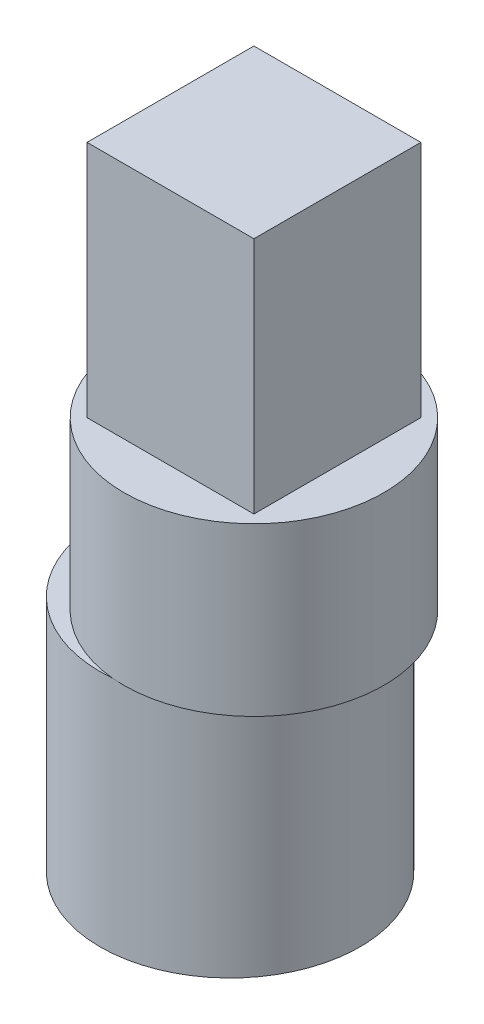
from build123d import *

# Parameters (mm, degrees)
SKIZZE1_R                       = 5.45
AUFSATZ_LINEAR_AUSTRAGEN1_DEPTH = 7
SKIZZE3_R                       = 5.45
AUFSATZ_LINEAR_AUSTRAGEN3_DEPTH = 10
SKIZZE4_W                       = 7
SKIZZE4_H                       = 7
AUFSATZ_LINEAR_AUSTRAGEN4_DEPTH = 10


with BuildPart() as part:
    # Skizze1 → Aufsatz-Linear austragen1 (new body)
    with BuildSketch(Plane(origin=(0, 0, 0), x_dir=(1, 0, 0), z_dir=(0, 1, 0))):
        with Locations(Location((0, 0, 0), (0, 0, 270))):
            Circle(SKIZZE1_R)
    extrude(amount=AUFSATZ_LINEAR_AUSTRAGEN1_DEPTH)

    # Skizze3 → Aufsatz-Linear austragen3 (add)
    with BuildSketch(Plane(origin=(0, 0, 0), x_dir=(-1, 0, 0), z_dir=(0, -1, 0))):
        with Locations(Location((1, 0, 0), (0, 0, 264.736104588))):
            Circle(SKIZZE3_R)
    extrude(amount=AUFSATZ_LINEAR_AUSTRAGEN3_DEPTH)

    # Skizze4 → Aufsatz-Linear austragen4 (add)
    with BuildSketch(Plane(origin=(0, 7, 0), x_dir=(1, 0, 0), z_dir=(0, 1, 0))):
        Rectangle(SKIZZE4_W, SKIZZE4_H)
    extrude(amount=AUFSATZ_LINEAR_AUSTRAGEN4_DEPTH)


solid = part.part
